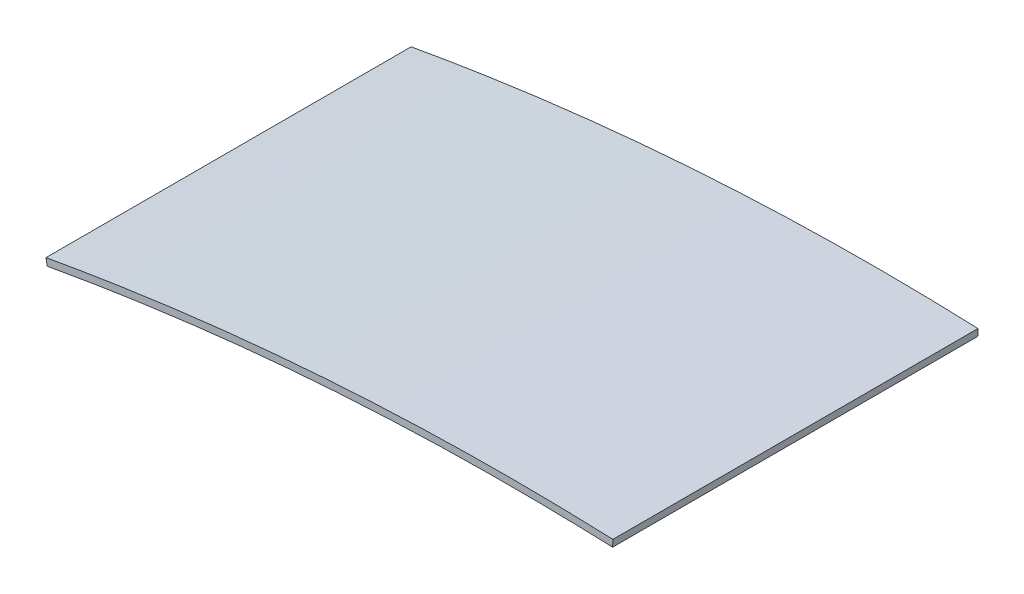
ISO-10303-21;
HEADER;
FILE_DESCRIPTION(('STEP AP214'),'2;1');
FILE_NAME('part.step','',(''),(''),'','','');
FILE_SCHEMA(('AUTOMOTIVE_DESIGN { 1 0 10303 214 1 1 1 1 }'));
ENDSEC;
DATA;
#1=APPLICATION_CONTEXT('core data for automotive mechanical design processes');
#2=APPLICATION_PROTOCOL_DEFINITION('international standard','automotive_design',2000,#1);
#3=PRODUCT_CONTEXT('',#1,'mechanical');
#4=PRODUCT('Part','Part','',(#3));
#5=PRODUCT_RELATED_PRODUCT_CATEGORY('part','',(#4));
#6=PRODUCT_DEFINITION_FORMATION('','',#4);
#7=PRODUCT_DEFINITION_CONTEXT('part definition',#1,'design');
#8=PRODUCT_DEFINITION('design','',#6,#7);
#9=PRODUCT_DEFINITION_SHAPE('','',#8);
#10=(LENGTH_UNIT() NAMED_UNIT(*) SI_UNIT(.MILLI.,.METRE.));
#11=(NAMED_UNIT(*) PLANE_ANGLE_UNIT() SI_UNIT($,.RADIAN.));
#12=(NAMED_UNIT(*) SI_UNIT($,.STERADIAN.) SOLID_ANGLE_UNIT());
#13=UNCERTAINTY_MEASURE_WITH_UNIT(LENGTH_MEASURE(1.E-05),#10,'distance_accuracy_value','');
#14=(GEOMETRIC_REPRESENTATION_CONTEXT(3) GLOBAL_UNCERTAINTY_ASSIGNED_CONTEXT((#13)) GLOBAL_UNIT_ASSIGNED_CONTEXT((#10,
#11,#12)) REPRESENTATION_CONTEXT('',''));
#15=CARTESIAN_POINT('',(0.,0.,0.));
#16=DIRECTION('',(0.,0.,1.));
#17=DIRECTION('',(1.,0.,0.));
#18=AXIS2_PLACEMENT_3D('',#15,#16,#17);
#19=CARTESIAN_POINT('',(75.0322057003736,7.93108154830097,84.));
#20=CARTESIAN_POINT('',(49.0733000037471,8.94523581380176,84.));
#21=CARTESIAN_POINT('',(5.44398631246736,7.85308197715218,84.));
#22=CARTESIAN_POINT('',(-37.8076640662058,2.02173970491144,84.));
#23=CARTESIAN_POINT('',(-55.3934239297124,-1.14679348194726,84.));
#24=B_SPLINE_CURVE_WITH_KNOTS('',3,(#19,#20,#21,#22,#23),.UNSPECIFIED.,.F.,.F.,(4,1,4),(0.,
0.59195450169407,1.),.UNSPECIFIED.);
#25=DIRECTION('',(0.,0.,-1.));
#26=VECTOR('',#25,1.);
#27=SURFACE_OF_LINEAR_EXTRUSION('',#24,#26);
#28=CARTESIAN_POINT('',(75.0322057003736,7.93108154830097,0.));
#29=CARTESIAN_POINT('',(49.0733000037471,8.94523581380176,0.));
#30=CARTESIAN_POINT('',(5.44398631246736,7.85308197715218,0.));
#31=CARTESIAN_POINT('',(-37.8076640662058,2.02173970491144,0.));
#32=CARTESIAN_POINT('',(-55.3934239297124,-1.14679348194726,0.));
#33=B_SPLINE_CURVE_WITH_KNOTS('',3,(#28,#29,#30,#31,#32),.UNSPECIFIED.,.F.,.F.,(4,1,4),(0.,
0.59195450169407,1.),.UNSPECIFIED.);
#34=CARTESIAN_POINT('',(75.0322057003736,7.93108154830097,0.));
#35=VERTEX_POINT('',#34);
#36=CARTESIAN_POINT('',(-55.3934239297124,-1.14679348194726,0.));
#37=VERTEX_POINT('',#36);
#38=EDGE_CURVE('E116',#35,#37,#33,.T.);
#39=ORIENTED_EDGE('',*,*,#38,.T.);
#40=DIRECTION('',(0.,0.,-1.));
#41=VECTOR('',#40,1.);
#42=CARTESIAN_POINT('',(-55.3934239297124,-1.14679348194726,84.));
#43=LINE('',#42,#41);
#44=CARTESIAN_POINT('',(-55.3934239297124,-1.14679348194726,84.));
#45=VERTEX_POINT('',#44);
#46=EDGE_CURVE('E11',#45,#37,#43,.T.);
#47=ORIENTED_EDGE('',*,*,#46,.F.);
#48=CARTESIAN_POINT('',(75.0322057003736,7.93108154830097,84.));
#49=VERTEX_POINT('',#48);
#50=EDGE_CURVE('E85',#49,#45,#24,.T.);
#51=ORIENTED_EDGE('',*,*,#50,.F.);
#52=DIRECTION('',(0.,0.,-1.));
#53=VECTOR('',#52,1.);
#54=CARTESIAN_POINT('',(75.0322057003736,7.93108154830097,84.));
#55=LINE('',#54,#53);
#56=EDGE_CURVE('E93',#49,#35,#55,.T.);
#57=ORIENTED_EDGE('',*,*,#56,.T.);
#58=EDGE_LOOP('',(#39,#47,#51,#57));
#59=FACE_BOUND('',#58,.T.);
#60=ADVANCED_FACE('F33',(#59),#27,.F.);
#61=CARTESIAN_POINT('',(-55.3934239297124,-1.14679348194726,84.));
#62=DIRECTION('',(0.984153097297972,0.177320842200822,0.));
#63=DIRECTION('',(-0.177320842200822,0.984153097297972,0.));
#64=AXIS2_PLACEMENT_3D('',#61,#62,#63);
#65=PLANE('',#64);
#66=DIRECTION('',(0.177320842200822,-0.984153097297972,0.));
#67=VECTOR('',#66,1.);
#68=CARTESIAN_POINT('',(-55.3934239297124,-1.14679348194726,0.));
#69=LINE('',#68,#67);
#70=CARTESIAN_POINT('',(-55.1097105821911,-2.72143843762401,0.));
#71=VERTEX_POINT('',#70);
#72=EDGE_CURVE('E89',#37,#71,#69,.T.);
#73=ORIENTED_EDGE('',*,*,#72,.T.);
#74=DIRECTION('',(0.,0.,-1.));
#75=VECTOR('',#74,1.);
#76=CARTESIAN_POINT('',(-55.1097105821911,-2.72143843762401,84.));
#77=LINE('',#76,#75);
#78=CARTESIAN_POINT('',(-55.1097105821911,-2.72143843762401,84.));
#79=VERTEX_POINT('',#78);
#80=EDGE_CURVE('E42',#79,#71,#77,.T.);
#81=ORIENTED_EDGE('',*,*,#80,.F.);
#82=DIRECTION('',(0.177320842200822,-0.984153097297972,0.));
#83=VECTOR('',#82,1.);
#84=CARTESIAN_POINT('',(-55.3934239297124,-1.14679348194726,84.));
#85=LINE('',#84,#83);
#86=EDGE_CURVE('E80',#45,#79,#85,.T.);
#87=ORIENTED_EDGE('',*,*,#86,.F.);
#88=ORIENTED_EDGE('',*,*,#46,.T.);
#89=EDGE_LOOP('',(#73,#81,#87,#88));
#90=FACE_BOUND('',#89,.T.);
#91=ADVANCED_FACE('F88',(#90),#65,.F.);
#92=CARTESIAN_POINT('',(-55.1097105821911,-2.72143843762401,84.));
#93=CARTESIAN_POINT('',(-49.7434430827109,-1.75456542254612,84.));
#94=CARTESIAN_POINT('',(-38.9759695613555,0.0356493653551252,84.));
#95=CARTESIAN_POINT('',(-17.4185432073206,3.02079367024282,84.));
#96=CARTESIAN_POINT('',(9.6235296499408,5.64594178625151,84.));
#97=CARTESIAN_POINT('',(36.7841428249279,6.79336536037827,84.));
#98=CARTESIAN_POINT('',(58.5760711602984,6.82551507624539,84.));
#99=CARTESIAN_POINT('',(69.5107939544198,6.54556974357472,84.));
#100=CARTESIAN_POINT('',(74.9697450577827,6.33230117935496,84.));
#101=B_SPLINE_CURVE_WITH_KNOTS('',3,(#92,#93,#94,#95,#96,#97,#98,#99,#100),.UNSPECIFIED.,.F.,
.F.,(4,1,1,1,1,1,4),(0.,0.125,0.25,0.5,0.75,0.875,1.),.UNSPECIFIED.);
#102=DIRECTION('',(0.,0.,-1.));
#103=VECTOR('',#102,1.);
#104=SURFACE_OF_LINEAR_EXTRUSION('',#101,#103);
#105=CARTESIAN_POINT('',(-55.1097105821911,-2.72143843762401,0.));
#106=CARTESIAN_POINT('',(-49.7434430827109,-1.75456542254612,0.));
#107=CARTESIAN_POINT('',(-38.9759695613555,0.0356493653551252,0.));
#108=CARTESIAN_POINT('',(-17.4185432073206,3.02079367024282,0.));
#109=CARTESIAN_POINT('',(9.6235296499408,5.64594178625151,0.));
#110=CARTESIAN_POINT('',(36.7841428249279,6.79336536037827,0.));
#111=CARTESIAN_POINT('',(58.5760711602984,6.82551507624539,0.));
#112=CARTESIAN_POINT('',(69.5107939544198,6.54556974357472,0.));
#113=CARTESIAN_POINT('',(74.9697450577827,6.33230117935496,0.));
#114=B_SPLINE_CURVE_WITH_KNOTS('',3,(#105,#106,#107,#108,#109,#110,#111,#112,#113),
.UNSPECIFIED.,.F.,.F.,(4,1,1,1,1,1,4),(0.,0.125,0.25,0.5,0.75,0.875,1.),.UNSPECIFIED.);
#115=CARTESIAN_POINT('',(74.9697450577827,6.33230117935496,0.));
#116=VERTEX_POINT('',#115);
#117=EDGE_CURVE('E67',#71,#116,#114,.T.);
#118=ORIENTED_EDGE('',*,*,#117,.T.);
#119=DIRECTION('',(0.,0.,-1.));
#120=VECTOR('',#119,1.);
#121=CARTESIAN_POINT('',(74.9697450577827,6.33230117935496,84.));
#122=LINE('',#121,#120);
#123=CARTESIAN_POINT('',(74.9697450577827,6.33230117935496,84.));
#124=VERTEX_POINT('',#123);
#125=EDGE_CURVE('E90',#124,#116,#122,.T.);
#126=ORIENTED_EDGE('',*,*,#125,.F.);
#127=EDGE_CURVE('E83',#79,#124,#101,.T.);
#128=ORIENTED_EDGE('',*,*,#127,.F.);
#129=ORIENTED_EDGE('',*,*,#80,.T.);
#130=EDGE_LOOP('',(#118,#126,#128,#129));
#131=FACE_BOUND('',#130,.T.);
#132=ADVANCED_FACE('F91',(#131),#104,.F.);
#133=CARTESIAN_POINT('',(75.0322057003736,7.93108154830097,84.));
#134=DIRECTION('',(-0.999237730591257,0.0390379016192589,0.));
#135=DIRECTION('',(-0.0390379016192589,-0.999237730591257,0.));
#136=AXIS2_PLACEMENT_3D('',#133,#134,#135);
#137=PLANE('',#136);
#138=DIRECTION('',(0.0390379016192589,0.999237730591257,0.));
#139=VECTOR('',#138,1.);
#140=CARTESIAN_POINT('',(75.0322057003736,7.93108154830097,0.));
#141=LINE('',#140,#139);
#142=EDGE_CURVE('E73',#116,#35,#141,.T.);
#143=ORIENTED_EDGE('',*,*,#142,.T.);
#144=ORIENTED_EDGE('',*,*,#56,.F.);
#145=DIRECTION('',(0.0390379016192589,0.999237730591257,0.));
#146=VECTOR('',#145,1.);
#147=CARTESIAN_POINT('',(75.0322057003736,7.93108154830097,84.));
#148=LINE('',#147,#146);
#149=EDGE_CURVE('E50',#124,#49,#148,.T.);
#150=ORIENTED_EDGE('',*,*,#149,.F.);
#151=ORIENTED_EDGE('',*,*,#125,.T.);
#152=EDGE_LOOP('',(#143,#144,#150,#151));
#153=FACE_BOUND('',#152,.T.);
#154=ADVANCED_FACE('F105',(#153),#137,.F.);
#155=CARTESIAN_POINT('',(9.53614340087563,6.94653535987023,84.));
#156=DIRECTION('',(0.,0.,1.));
#157=DIRECTION('',(1.,0.,0.));
#158=AXIS2_PLACEMENT_3D('',#155,#156,#157);
#159=PLANE('',#158);
#160=ORIENTED_EDGE('',*,*,#50,.T.);
#161=ORIENTED_EDGE('',*,*,#86,.T.);
#162=ORIENTED_EDGE('',*,*,#127,.T.);
#163=ORIENTED_EDGE('',*,*,#149,.T.);
#164=EDGE_LOOP('',(#160,#161,#162,#163));
#165=FACE_BOUND('',#164,.T.);
#166=ADVANCED_FACE('F81',(#165),#159,.T.);
#167=CARTESIAN_POINT('',(9.53614340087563,6.94653535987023,0.));
#168=DIRECTION('',(0.,0.,1.));
#169=DIRECTION('',(1.,0.,0.));
#170=AXIS2_PLACEMENT_3D('',#167,#168,#169);
#171=PLANE('',#170);
#172=ORIENTED_EDGE('',*,*,#38,.F.);
#173=ORIENTED_EDGE('',*,*,#142,.F.);
#174=ORIENTED_EDGE('',*,*,#117,.F.);
#175=ORIENTED_EDGE('',*,*,#72,.F.);
#176=EDGE_LOOP('',(#172,#173,#174,#175));
#177=FACE_BOUND('',#176,.T.);
#178=ADVANCED_FACE('F133',(#177),#171,.F.);
#179=CLOSED_SHELL('',(#60,#91,#132,#154,#166,#178));
#180=MANIFOLD_SOLID_BREP('B2',#179);
#181=ADVANCED_BREP_SHAPE_REPRESENTATION('',(#18,#180),#14);
#182=SHAPE_DEFINITION_REPRESENTATION(#9,#181);
ENDSEC;
END-ISO-10303-21;
